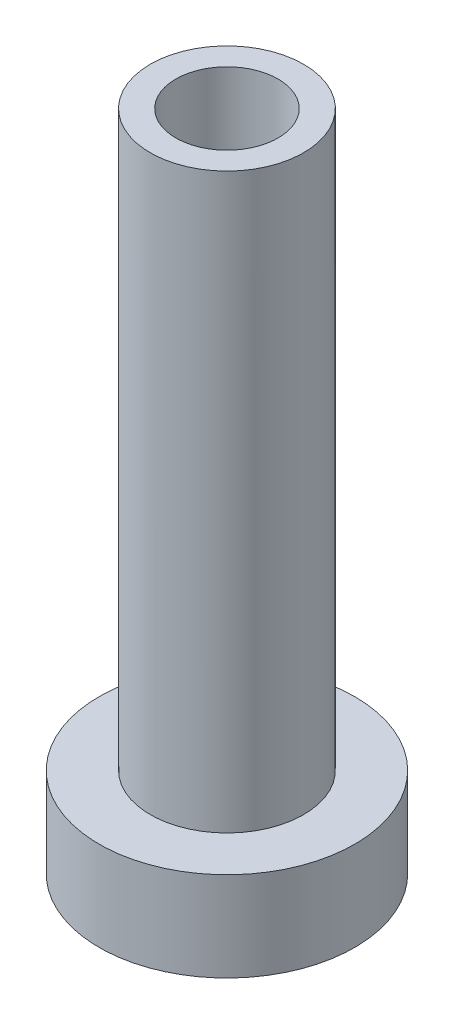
from build123d import *

# Parameters (mm, degrees)
ESQUISSE2_R             = 4.25
ENL_V_MAT_EXTRU_1_DEPTH = 40
CHANFREIN1_SIZE         = 1
ENL_V_START             = -23.15
ESQUISSE3_R             = 6
ENL_V_MAT_EXTRU_2_DEPTH = 23.15


with BuildPart() as part:
    # Esquisse1 → R_volution1 (revolve)
    with BuildSketch(Plane.XY, mode=Mode.PRIVATE) as r_volution1_sk:
        Polygon((-4, 0), (-10, 0), (-10, 7), (-6, 7), (-6, 75), (-4, 75), align=None)
    revolve(r_volution1_sk.sketch.rotate(Axis((0, 0, 0), (0, 1, 0)), 270), axis=Axis((0, 0, 0), (0, 1, 0)))

    # Esquisse2 → Enl_v. mat.-Extru.1 (cut)
    with BuildSketch(Plane(origin=(0, 0, 0), x_dir=(1, 0, 0), z_dir=(0, 1, 0))):
        with Locations(Location((0, 0, 0), (0, 0, 270))):
            Circle(ESQUISSE2_R)
    extrude(amount=ENL_V_MAT_EXTRU_1_DEPTH, mode=Mode.SUBTRACT)

    # Chanfrein1
    chanfrein1_edges = [part.edges().sort_by_distance(p)[0] for p in [
        (0, 0, -4.25),
    ]]
    chamfer(chanfrein1_edges, length=CHANFREIN1_SIZE)

    # Esquisse3 → Enl_v. mat.-Extru.2 (cut)
    with BuildSketch(Plane(origin=(0, 75, 0), x_dir=(1, 0, 0), z_dir=(0, 1, 0)).offset(ENL_V_START)):
        with Locations(Location((0, 0, 0), (0, 0, 90))):
            Circle(ESQUISSE3_R)
    extrude(amount=ENL_V_MAT_EXTRU_2_DEPTH, mode=Mode.SUBTRACT)


solid = part.part
